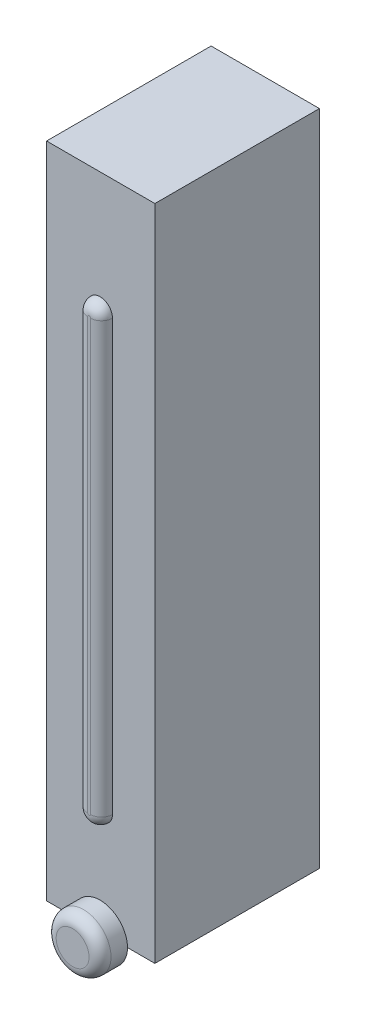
ISO-10303-21;
HEADER;
FILE_DESCRIPTION(('STEP AP214'),'2;1');
FILE_NAME('part.step','',(''),(''),'','','');
FILE_SCHEMA(('AUTOMOTIVE_DESIGN { 1 0 10303 214 1 1 1 1 }'));
ENDSEC;
DATA;
#1=APPLICATION_CONTEXT('core data for automotive mechanical design processes');
#2=APPLICATION_PROTOCOL_DEFINITION('international standard','automotive_design',2000,#1);
#3=PRODUCT_CONTEXT('',#1,'mechanical');
#4=PRODUCT('Part','Part','',(#3));
#5=PRODUCT_RELATED_PRODUCT_CATEGORY('part','',(#4));
#6=PRODUCT_DEFINITION_FORMATION('','',#4);
#7=PRODUCT_DEFINITION_CONTEXT('part definition',#1,'design');
#8=PRODUCT_DEFINITION('design','',#6,#7);
#9=PRODUCT_DEFINITION_SHAPE('','',#8);
#10=(LENGTH_UNIT() NAMED_UNIT(*) SI_UNIT(.MILLI.,.METRE.));
#11=(NAMED_UNIT(*) PLANE_ANGLE_UNIT() SI_UNIT($,.RADIAN.));
#12=(NAMED_UNIT(*) SI_UNIT($,.STERADIAN.) SOLID_ANGLE_UNIT());
#13=UNCERTAINTY_MEASURE_WITH_UNIT(LENGTH_MEASURE(1.E-05),#10,'distance_accuracy_value','');
#14=(GEOMETRIC_REPRESENTATION_CONTEXT(3) GLOBAL_UNCERTAINTY_ASSIGNED_CONTEXT((#13)) GLOBAL_UNIT_ASSIGNED_CONTEXT((#10,
#11,#12)) REPRESENTATION_CONTEXT('',''));
#15=CARTESIAN_POINT('',(0.,0.,0.));
#16=DIRECTION('',(0.,0.,1.));
#17=DIRECTION('',(1.,0.,0.));
#18=AXIS2_PLACEMENT_3D('',#15,#16,#17);
#19=CARTESIAN_POINT('',(0.,304.8,76.2));
#20=DIRECTION('',(0.,0.,-1.));
#21=DIRECTION('',(-1.,0.,0.));
#22=AXIS2_PLACEMENT_3D('',#19,#20,#21);
#23=PLANE('',#22);
#24=DIRECTION('',(0.,1.,0.));
#25=VECTOR('',#24,1.);
#26=CARTESIAN_POINT('',(51.435,304.8,76.2));
#27=LINE('',#26,#25);
#28=CARTESIAN_POINT('',(51.4350000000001,0.,76.2));
#29=VERTEX_POINT('',#28);
#30=CARTESIAN_POINT('',(51.435,304.8,76.2));
#31=VERTEX_POINT('',#30);
#32=EDGE_CURVE('E160',#29,#31,#27,.T.);
#33=ORIENTED_EDGE('',*,*,#32,.F.);
#34=DIRECTION('',(1.,0.,0.));
#35=VECTOR('',#34,1.);
#36=CARTESIAN_POINT('',(0.,0.,76.2));
#37=LINE('',#36,#35);
#38=CARTESIAN_POINT('',(63.5,0.,76.2));
#39=VERTEX_POINT('',#38);
#40=EDGE_CURVE('E128',#29,#39,#37,.T.);
#41=ORIENTED_EDGE('',*,*,#40,.T.);
#42=CARTESIAN_POINT('',(76.2,0.,76.2));
#43=DIRECTION('',(0.,0.,1.));
#44=DIRECTION('',(1.,0.,0.));
#45=AXIS2_PLACEMENT_3D('',#42,#43,#44);
#46=CIRCLE('',#45,12.7);
#47=CARTESIAN_POINT('',(88.9,0.,76.2));
#48=VERTEX_POINT('',#47);
#49=EDGE_CURVE('E156',#48,#39,#46,.T.);
#50=ORIENTED_EDGE('',*,*,#49,.F.);
#51=CARTESIAN_POINT('',(101.6,0.,76.2));
#52=VERTEX_POINT('',#51);
#53=EDGE_CURVE('E131',#48,#52,#37,.T.);
#54=ORIENTED_EDGE('',*,*,#53,.T.);
#55=DIRECTION('',(0.,-1.,0.));
#56=VECTOR('',#55,1.);
#57=CARTESIAN_POINT('',(101.6,304.8,76.2));
#58=LINE('',#57,#56);
#59=CARTESIAN_POINT('',(101.6,304.8,76.2));
#60=VERTEX_POINT('',#59);
#61=EDGE_CURVE('E137',#60,#52,#58,.T.);
#62=ORIENTED_EDGE('',*,*,#61,.F.);
#63=DIRECTION('',(1.,0.,0.));
#64=VECTOR('',#63,1.);
#65=CARTESIAN_POINT('',(0.,304.8,76.2));
#66=LINE('',#65,#64);
#67=EDGE_CURVE('E152',#31,#60,#66,.T.);
#68=ORIENTED_EDGE('',*,*,#67,.F.);
#69=EDGE_LOOP('',(#33,#41,#50,#54,#62,#68));
#70=FACE_BOUND('',#69,.T.);
#71=CARTESIAN_POINT('',(76.2,248.986126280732,76.2));
#72=DIRECTION('',(0.,0.,1.));
#73=DIRECTION('',(-1.,0.,0.));
#74=AXIS2_PLACEMENT_3D('',#71,#72,#73);
#75=CIRCLE('',#74,5.75969716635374);
#76=CARTESIAN_POINT('',(81.9596971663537,248.986126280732,76.2));
#77=VERTEX_POINT('',#76);
#78=CARTESIAN_POINT('',(70.4403028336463,248.986126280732,76.2));
#79=VERTEX_POINT('',#78);
#80=EDGE_CURVE('E107',#77,#79,#75,.T.);
#81=ORIENTED_EDGE('',*,*,#80,.F.);
#82=DIRECTION('',(0.,1.,0.));
#83=VECTOR('',#82,1.);
#84=CARTESIAN_POINT('',(81.9596971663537,248.986126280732,76.2));
#85=LINE('',#84,#83);
#86=CARTESIAN_POINT('',(81.9596971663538,49.9073626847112,76.2));
#87=VERTEX_POINT('',#86);
#88=EDGE_CURVE('E111',#87,#77,#85,.T.);
#89=ORIENTED_EDGE('',*,*,#88,.F.);
#90=CARTESIAN_POINT('',(76.2,49.9073626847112,76.2));
#91=DIRECTION('',(0.,0.,1.));
#92=DIRECTION('',(1.,0.,0.));
#93=AXIS2_PLACEMENT_3D('',#90,#91,#92);
#94=CIRCLE('',#93,5.75969716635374);
#95=CARTESIAN_POINT('',(70.4403028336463,49.9073626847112,76.2));
#96=VERTEX_POINT('',#95);
#97=EDGE_CURVE('E129',#96,#87,#94,.T.);
#98=ORIENTED_EDGE('',*,*,#97,.F.);
#99=DIRECTION('',(0.,-1.,0.));
#100=VECTOR('',#99,1.);
#101=CARTESIAN_POINT('',(70.4403028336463,248.986126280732,76.2));
#102=LINE('',#101,#100);
#103=EDGE_CURVE('E114',#79,#96,#102,.T.);
#104=ORIENTED_EDGE('',*,*,#103,.F.);
#105=EDGE_LOOP('',(#81,#89,#98,#104));
#106=FACE_BOUND('',#105,.T.);
#107=ADVANCED_FACE('F37',(#70,#106),#23,.F.);
#108=CARTESIAN_POINT('',(0.,304.8,0.));
#109=DIRECTION('',(0.,0.,1.));
#110=DIRECTION('',(1.,0.,0.));
#111=AXIS2_PLACEMENT_3D('',#108,#109,#110);
#112=PLANE('',#111);
#113=DIRECTION('',(0.,-1.,0.));
#114=VECTOR('',#113,1.);
#115=CARTESIAN_POINT('',(51.435,304.8,0.));
#116=LINE('',#115,#114);
#117=CARTESIAN_POINT('',(51.435,304.8,0.));
#118=VERTEX_POINT('',#117);
#119=CARTESIAN_POINT('',(51.4350000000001,0.,0.));
#120=VERTEX_POINT('',#119);
#121=EDGE_CURVE('E163',#118,#120,#116,.T.);
#122=ORIENTED_EDGE('',*,*,#121,.F.);
#123=DIRECTION('',(-1.,0.,0.));
#124=VECTOR('',#123,1.);
#125=CARTESIAN_POINT('',(0.,304.8,0.));
#126=LINE('',#125,#124);
#127=CARTESIAN_POINT('',(101.6,304.8,0.));
#128=VERTEX_POINT('',#127);
#129=EDGE_CURVE('E147',#128,#118,#126,.T.);
#130=ORIENTED_EDGE('',*,*,#129,.F.);
#131=DIRECTION('',(0.,-1.,0.));
#132=VECTOR('',#131,1.);
#133=CARTESIAN_POINT('',(101.6,304.8,0.));
#134=LINE('',#133,#132);
#135=CARTESIAN_POINT('',(101.6,0.,0.));
#136=VERTEX_POINT('',#135);
#137=EDGE_CURVE('E141',#128,#136,#134,.T.);
#138=ORIENTED_EDGE('',*,*,#137,.T.);
#139=DIRECTION('',(-1.,0.,0.));
#140=VECTOR('',#139,1.);
#141=CARTESIAN_POINT('',(0.,0.,0.));
#142=LINE('',#141,#140);
#143=EDGE_CURVE('E144',#136,#120,#142,.T.);
#144=ORIENTED_EDGE('',*,*,#143,.T.);
#145=EDGE_LOOP('',(#122,#130,#138,#144));
#146=FACE_BOUND('',#145,.T.);
#147=ADVANCED_FACE('F201',(#146),#112,.F.);
#148=CARTESIAN_POINT('',(0.,304.8,0.));
#149=DIRECTION('',(0.,1.,0.));
#150=DIRECTION('',(0.,0.,1.));
#151=AXIS2_PLACEMENT_3D('',#148,#149,#150);
#152=PLANE('',#151);
#153=ORIENTED_EDGE('',*,*,#129,.T.);
#154=DIRECTION('',(0.,0.,-1.));
#155=VECTOR('',#154,1.);
#156=CARTESIAN_POINT('',(51.435,304.8,195.072));
#157=LINE('',#156,#155);
#158=EDGE_CURVE('E162',#31,#118,#157,.T.);
#159=ORIENTED_EDGE('',*,*,#158,.F.);
#160=ORIENTED_EDGE('',*,*,#67,.T.);
#161=DIRECTION('',(0.,0.,-1.));
#162=VECTOR('',#161,1.);
#163=CARTESIAN_POINT('',(101.6,304.8,0.));
#164=LINE('',#163,#162);
#165=EDGE_CURVE('E153',#60,#128,#164,.T.);
#166=ORIENTED_EDGE('',*,*,#165,.T.);
#167=EDGE_LOOP('',(#153,#159,#160,#166));
#168=FACE_BOUND('',#167,.T.);
#169=ADVANCED_FACE('F208',(#168),#152,.T.);
#170=CARTESIAN_POINT('',(0.,0.,0.));
#171=DIRECTION('',(0.,1.,0.));
#172=DIRECTION('',(0.,0.,1.));
#173=AXIS2_PLACEMENT_3D('',#170,#171,#172);
#174=PLANE('',#173);
#175=CARTESIAN_POINT('',(76.5175,0.,38.1));
#176=DIRECTION('',(0.,1.,0.));
#177=DIRECTION('',(0.,0.,1.));
#178=AXIS2_PLACEMENT_3D('',#175,#176,#177);
#179=CIRCLE('',#178,10.2564098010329);
#180=CARTESIAN_POINT('',(76.5175,0.,48.3564098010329));
#181=VERTEX_POINT('',#180);
#182=EDGE_CURVE('E11',#181,#181,#179,.F.);
#183=ORIENTED_EDGE('',*,*,#182,.F.);
#184=EDGE_LOOP('',(#183));
#185=FACE_BOUND('',#184,.T.);
#186=DIRECTION('',(0.,0.,-1.));
#187=VECTOR('',#186,1.);
#188=CARTESIAN_POINT('',(51.4350000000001,0.,195.072));
#189=LINE('',#188,#187);
#190=EDGE_CURVE('E149',#29,#120,#189,.T.);
#191=ORIENTED_EDGE('',*,*,#190,.T.);
#192=ORIENTED_EDGE('',*,*,#143,.F.);
#193=DIRECTION('',(0.,0.,-1.));
#194=VECTOR('',#193,1.);
#195=CARTESIAN_POINT('',(101.6,0.,0.));
#196=LINE('',#195,#194);
#197=EDGE_CURVE('E140',#52,#136,#196,.T.);
#198=ORIENTED_EDGE('',*,*,#197,.F.);
#199=ORIENTED_EDGE('',*,*,#53,.F.);
#200=EDGE_CURVE('E133',#39,#48,#37,.T.);
#201=ORIENTED_EDGE('',*,*,#200,.F.);
#202=ORIENTED_EDGE('',*,*,#40,.F.);
#203=EDGE_LOOP('',(#191,#192,#198,#199,#201,#202));
#204=FACE_BOUND('',#203,.T.);
#205=ADVANCED_FACE('F215',(#185,#204),#174,.F.);
#206=CARTESIAN_POINT('',(101.6,304.8,0.));
#207=DIRECTION('',(-1.,0.,0.));
#208=DIRECTION('',(0.,0.,1.));
#209=AXIS2_PLACEMENT_3D('',#206,#207,#208);
#210=PLANE('',#209);
#211=ORIENTED_EDGE('',*,*,#197,.T.);
#212=ORIENTED_EDGE('',*,*,#137,.F.);
#213=ORIENTED_EDGE('',*,*,#165,.F.);
#214=ORIENTED_EDGE('',*,*,#61,.T.);
#215=EDGE_LOOP('',(#211,#212,#213,#214));
#216=FACE_BOUND('',#215,.T.);
#217=ADVANCED_FACE('F213',(#216),#210,.F.);
#218=CARTESIAN_POINT('',(0.,0.,76.2));
#219=DIRECTION('',(0.,0.,1.));
#220=DIRECTION('',(1.,0.,0.));
#221=AXIS2_PLACEMENT_3D('',#218,#219,#220);
#222=PLANE('',#221);
#223=EDGE_CURVE('E159',#39,#48,#46,.T.);
#224=ORIENTED_EDGE('',*,*,#223,.F.);
#225=ORIENTED_EDGE('',*,*,#200,.T.);
#226=EDGE_LOOP('',(#224,#225));
#227=FACE_BOUND('',#226,.T.);
#228=ADVANCED_FACE('F214',(#227),#222,.F.);
#229=CARTESIAN_POINT('',(76.2,0.,88.9));
#230=DIRECTION('',(0.,0.,-1.));
#231=DIRECTION('',(-1.,0.,0.));
#232=AXIS2_PLACEMENT_3D('',#229,#230,#231);
#233=CYLINDRICAL_SURFACE('',#232,12.7);
#234=CARTESIAN_POINT('',(76.2,0.,83.82));
#235=DIRECTION('',(0.,0.,1.));
#236=DIRECTION('',(1.,0.,0.));
#237=AXIS2_PLACEMENT_3D('',#234,#235,#236);
#238=CIRCLE('',#237,12.7);
#239=CARTESIAN_POINT('',(88.9,0.,83.82));
#240=VERTEX_POINT('',#239);
#241=EDGE_CURVE('E171',#240,#240,#238,.F.);
#242=ORIENTED_EDGE('',*,*,#241,.T.);
#243=EDGE_LOOP('',(#242));
#244=FACE_BOUND('',#243,.T.);
#245=ORIENTED_EDGE('',*,*,#49,.T.);
#246=ORIENTED_EDGE('',*,*,#223,.T.);
#247=EDGE_LOOP('',(#245,#246));
#248=FACE_BOUND('',#247,.T.);
#249=ADVANCED_FACE('F225',(#244,#248),#233,.T.);
#250=CARTESIAN_POINT('',(0.,0.,88.9));
#251=DIRECTION('',(0.,0.,1.));
#252=DIRECTION('',(1.,0.,0.));
#253=AXIS2_PLACEMENT_3D('',#250,#251,#252);
#254=PLANE('',#253);
#255=CARTESIAN_POINT('',(76.2,0.,88.9));
#256=DIRECTION('',(0.,0.,1.));
#257=DIRECTION('',(1.,0.,0.));
#258=AXIS2_PLACEMENT_3D('',#255,#256,#257);
#259=CIRCLE('',#258,7.62000000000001);
#260=CARTESIAN_POINT('',(83.82,0.,88.9));
#261=VERTEX_POINT('',#260);
#262=EDGE_CURVE('E165',#261,#261,#259,.T.);
#263=ORIENTED_EDGE('',*,*,#262,.T.);
#264=EDGE_LOOP('',(#263));
#265=FACE_BOUND('',#264,.T.);
#266=ADVANCED_FACE('F228',(#265),#254,.T.);
#267=CARTESIAN_POINT('',(51.435,304.8,195.072));
#268=DIRECTION('',(-1.,0.,0.));
#269=DIRECTION('',(0.,-1.,0.));
#270=AXIS2_PLACEMENT_3D('',#267,#268,#269);
#271=PLANE('',#270);
#272=ORIENTED_EDGE('',*,*,#32,.T.);
#273=ORIENTED_EDGE('',*,*,#158,.T.);
#274=ORIENTED_EDGE('',*,*,#121,.T.);
#275=ORIENTED_EDGE('',*,*,#190,.F.);
#276=EDGE_LOOP('',(#272,#273,#274,#275));
#277=FACE_BOUND('',#276,.T.);
#278=ADVANCED_FACE('F195',(#277),#271,.T.);
#279=CARTESIAN_POINT('',(76.2,0.,83.82));
#280=DIRECTION('',(0.,0.,1.));
#281=DIRECTION('',(1.,0.,0.));
#282=AXIS2_PLACEMENT_3D('',#279,#280,#281);
#283=TOROIDAL_SURFACE('',#282,7.62000000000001,5.08);
#284=ORIENTED_EDGE('',*,*,#241,.F.);
#285=EDGE_LOOP('',(#284));
#286=FACE_BOUND('',#285,.T.);
#287=ORIENTED_EDGE('',*,*,#262,.F.);
#288=EDGE_LOOP('',(#287));
#289=FACE_BOUND('',#288,.T.);
#290=ADVANCED_FACE('F188',(#286,#289),#283,.T.);
#291=CARTESIAN_POINT('',(76.2,248.986126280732,81.28));
#292=DIRECTION('',(0.,0.,-1.));
#293=DIRECTION('',(-1.,0.,0.));
#294=AXIS2_PLACEMENT_3D('',#291,#292,#293);
#295=PLANE('',#294);
#296=DIRECTION('',(0.,-1.,0.));
#297=VECTOR('',#296,1.);
#298=CARTESIAN_POINT('',(75.5203028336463,248.986126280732,81.28));
#299=LINE('',#298,#297);
#300=CARTESIAN_POINT('',(75.5203028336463,248.986126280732,81.28));
#301=VERTEX_POINT('',#300);
#302=CARTESIAN_POINT('',(75.5203028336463,49.9073626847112,81.28));
#303=VERTEX_POINT('',#302);
#304=EDGE_CURVE('E52',#301,#303,#299,.T.);
#305=ORIENTED_EDGE('',*,*,#304,.T.);
#306=CARTESIAN_POINT('',(76.2,49.9073626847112,81.28));
#307=DIRECTION('',(0.,0.,-1.));
#308=DIRECTION('',(-1.,0.,0.));
#309=AXIS2_PLACEMENT_3D('',#306,#307,#308);
#310=CIRCLE('',#309,0.679697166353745);
#311=CARTESIAN_POINT('',(76.8796971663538,49.9073626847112,81.28));
#312=VERTEX_POINT('',#311);
#313=EDGE_CURVE('E45',#303,#312,#310,.F.);
#314=ORIENTED_EDGE('',*,*,#313,.T.);
#315=DIRECTION('',(0.,1.,0.));
#316=VECTOR('',#315,1.);
#317=CARTESIAN_POINT('',(76.8796971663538,248.986126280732,81.28));
#318=LINE('',#317,#316);
#319=CARTESIAN_POINT('',(76.8796971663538,248.986126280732,81.28));
#320=VERTEX_POINT('',#319);
#321=EDGE_CURVE('E174',#312,#320,#318,.T.);
#322=ORIENTED_EDGE('',*,*,#321,.T.);
#323=CARTESIAN_POINT('',(76.2,248.986126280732,81.28));
#324=DIRECTION('',(0.,0.,-1.));
#325=DIRECTION('',(-1.,0.,0.));
#326=AXIS2_PLACEMENT_3D('',#323,#324,#325);
#327=CIRCLE('',#326,0.679697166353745);
#328=EDGE_CURVE('E57',#320,#301,#327,.F.);
#329=ORIENTED_EDGE('',*,*,#328,.T.);
#330=EDGE_LOOP('',(#305,#314,#322,#329));
#331=FACE_BOUND('',#330,.T.);
#332=ADVANCED_FACE('F186',(#331),#295,.F.);
#333=CARTESIAN_POINT('',(76.2,248.986126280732,76.2));
#334=DIRECTION('',(0.,0.,-1.));
#335=DIRECTION('',(-1.,0.,0.));
#336=AXIS2_PLACEMENT_3D('',#333,#334,#335);
#337=DEGENERATE_TOROIDAL_SURFACE('',#336,0.679697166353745,5.08,.T.);
#338=CARTESIAN_POINT('',(76.8796971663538,248.986126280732,76.2));
#339=DIRECTION('',(0.,-1.,0.));
#340=DIRECTION('',(0.,0.,-1.));
#341=AXIS2_PLACEMENT_3D('',#338,#339,#340);
#342=CIRCLE('',#341,5.08);
#343=EDGE_CURVE('E120',#77,#320,#342,.T.);
#344=ORIENTED_EDGE('',*,*,#343,.F.);
#345=ORIENTED_EDGE('',*,*,#80,.T.);
#346=CARTESIAN_POINT('',(75.5203028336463,248.986126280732,76.2));
#347=DIRECTION('',(0.,-1.,0.));
#348=DIRECTION('',(0.,0.,-1.));
#349=AXIS2_PLACEMENT_3D('',#346,#347,#348);
#350=CIRCLE('',#349,5.08);
#351=EDGE_CURVE('E117',#301,#79,#350,.T.);
#352=ORIENTED_EDGE('',*,*,#351,.F.);
#353=ORIENTED_EDGE('',*,*,#328,.F.);
#354=EDGE_LOOP('',(#344,#345,#352,#353));
#355=FACE_BOUND('',#354,.T.);
#356=ADVANCED_FACE('F39',(#355),#337,.T.);
#357=CARTESIAN_POINT('',(75.5203028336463,248.986126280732,76.2));
#358=DIRECTION('',(0.,-1.,0.));
#359=DIRECTION('',(1.,0.,0.));
#360=AXIS2_PLACEMENT_3D('',#357,#358,#359);
#361=CYLINDRICAL_SURFACE('',#360,5.08);
#362=ORIENTED_EDGE('',*,*,#351,.T.);
#363=ORIENTED_EDGE('',*,*,#103,.T.);
#364=CARTESIAN_POINT('',(75.5203028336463,49.9073626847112,76.2));
#365=DIRECTION('',(0.,-1.,0.));
#366=DIRECTION('',(0.,0.,-1.));
#367=AXIS2_PLACEMENT_3D('',#364,#365,#366);
#368=CIRCLE('',#367,5.08);
#369=EDGE_CURVE('E123',#303,#96,#368,.T.);
#370=ORIENTED_EDGE('',*,*,#369,.F.);
#371=ORIENTED_EDGE('',*,*,#304,.F.);
#372=EDGE_LOOP('',(#362,#363,#370,#371));
#373=FACE_BOUND('',#372,.T.);
#374=ADVANCED_FACE('F182',(#373),#361,.T.);
#375=CARTESIAN_POINT('',(76.8796971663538,248.986126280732,76.2));
#376=DIRECTION('',(0.,1.,0.));
#377=DIRECTION('',(-1.,0.,0.));
#378=AXIS2_PLACEMENT_3D('',#375,#376,#377);
#379=CYLINDRICAL_SURFACE('',#378,5.08);
#380=ORIENTED_EDGE('',*,*,#343,.T.);
#381=ORIENTED_EDGE('',*,*,#321,.F.);
#382=CARTESIAN_POINT('',(76.8796971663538,49.9073626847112,76.2));
#383=DIRECTION('',(0.,-1.,0.));
#384=DIRECTION('',(0.,0.,-1.));
#385=AXIS2_PLACEMENT_3D('',#382,#383,#384);
#386=CIRCLE('',#385,5.08);
#387=EDGE_CURVE('E127',#87,#312,#386,.T.);
#388=ORIENTED_EDGE('',*,*,#387,.F.);
#389=ORIENTED_EDGE('',*,*,#88,.T.);
#390=EDGE_LOOP('',(#380,#381,#388,#389));
#391=FACE_BOUND('',#390,.T.);
#392=ADVANCED_FACE('F126',(#391),#379,.T.);
#393=CARTESIAN_POINT('',(76.2,49.9073626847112,76.2));
#394=DIRECTION('',(0.,0.,-1.));
#395=DIRECTION('',(-1.,0.,0.));
#396=AXIS2_PLACEMENT_3D('',#393,#394,#395);
#397=DEGENERATE_TOROIDAL_SURFACE('',#396,0.679697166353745,5.08,.T.);
#398=ORIENTED_EDGE('',*,*,#369,.T.);
#399=ORIENTED_EDGE('',*,*,#97,.T.);
#400=ORIENTED_EDGE('',*,*,#387,.T.);
#401=ORIENTED_EDGE('',*,*,#313,.F.);
#402=EDGE_LOOP('',(#398,#399,#400,#401));
#403=FACE_BOUND('',#402,.T.);
#404=ADVANCED_FACE('F185',(#403),#397,.T.);
#405=CARTESIAN_POINT('',(76.5175,-9.652,38.1));
#406=DIRECTION('',(0.,-1.,0.));
#407=DIRECTION('',(0.,0.,-1.));
#408=AXIS2_PLACEMENT_3D('',#405,#406,#407);
#409=PLANE('',#408);
#410=CARTESIAN_POINT('',(76.5175,-9.652,38.1));
#411=DIRECTION('',(0.,-1.,0.));
#412=DIRECTION('',(0.,0.,-1.));
#413=AXIS2_PLACEMENT_3D('',#410,#411,#412);
#414=CIRCLE('',#413,10.2564098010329);
#415=CARTESIAN_POINT('',(76.5175,-9.652,48.3564098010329));
#416=VERTEX_POINT('',#415);
#417=EDGE_CURVE('E180',#416,#416,#414,.T.);
#418=ORIENTED_EDGE('',*,*,#417,.T.);
#419=EDGE_LOOP('',(#418));
#420=FACE_BOUND('',#419,.T.);
#421=CARTESIAN_POINT('',(76.5175,-9.652,38.1));
#422=DIRECTION('',(0.,-1.,0.));
#423=DIRECTION('',(0.,0.,-1.));
#424=AXIS2_PLACEMENT_3D('',#421,#422,#423);
#425=CIRCLE('',#424,7.7164098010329);
#426=CARTESIAN_POINT('',(76.5175,-9.652,45.8164098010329));
#427=VERTEX_POINT('',#426);
#428=EDGE_CURVE('E402',#427,#427,#425,.T.);
#429=ORIENTED_EDGE('',*,*,#428,.F.);
#430=EDGE_LOOP('',(#429));
#431=FACE_BOUND('',#430,.T.);
#432=ADVANCED_FACE('F240',(#420,#431),#409,.T.);
#433=CARTESIAN_POINT('',(76.5175,-9.652,38.1));
#434=DIRECTION('',(0.,1.,0.));
#435=DIRECTION('',(0.,0.,1.));
#436=AXIS2_PLACEMENT_3D('',#433,#434,#435);
#437=CYLINDRICAL_SURFACE('',#436,10.2564098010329);
#438=CARTESIAN_POINT('',(76.5175,-9.652,48.3564098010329));
#439=CARTESIAN_POINT('',(76.5175,-9.55145833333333,48.3564098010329));
#440=CARTESIAN_POINT('',(76.5175,-9.45091666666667,48.3564098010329));
#441=CARTESIAN_POINT('',(76.5175,-9.24983333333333,48.3564098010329));
#442=CARTESIAN_POINT('',(76.5175,-9.14929166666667,48.3564098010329));
#443=CARTESIAN_POINT('',(76.5175,-8.94820833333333,48.3564098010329));
#444=CARTESIAN_POINT('',(76.5175,-8.84766666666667,48.3564098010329));
#445=CARTESIAN_POINT('',(76.5175,-8.64658333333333,48.3564098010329));
#446=CARTESIAN_POINT('',(76.5175,-8.54604166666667,48.3564098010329));
#447=CARTESIAN_POINT('',(76.5175,-8.34495833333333,48.3564098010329));
#448=CARTESIAN_POINT('',(76.5175,-8.24441666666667,48.3564098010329));
#449=CARTESIAN_POINT('',(76.5175,-8.04333333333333,48.3564098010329));
#450=CARTESIAN_POINT('',(76.5175,-7.94279166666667,48.3564098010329));
#451=CARTESIAN_POINT('',(76.5175,-7.74170833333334,48.3564098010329));
#452=CARTESIAN_POINT('',(76.5175,-7.64116666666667,48.3564098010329));
#453=CARTESIAN_POINT('',(76.5175,-7.44008333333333,48.3564098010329));
#454=CARTESIAN_POINT('',(76.5175,-7.33954166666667,48.3564098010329));
#455=CARTESIAN_POINT('',(76.5175,-7.13845833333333,48.3564098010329));
#456=CARTESIAN_POINT('',(76.5175,-7.03791666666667,48.3564098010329));
#457=CARTESIAN_POINT('',(76.5175,-6.83683333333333,48.3564098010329));
#458=CARTESIAN_POINT('',(76.5175,-6.73629166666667,48.3564098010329));
#459=CARTESIAN_POINT('',(76.5175,-6.53520833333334,48.3564098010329));
#460=CARTESIAN_POINT('',(76.5175,-6.43466666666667,48.3564098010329));
#461=CARTESIAN_POINT('',(76.5175,-6.23358333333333,48.3564098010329));
#462=CARTESIAN_POINT('',(76.5175,-6.13304166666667,48.3564098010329));
#463=CARTESIAN_POINT('',(76.5175,-5.93195833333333,48.3564098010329));
#464=CARTESIAN_POINT('',(76.5175,-5.83141666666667,48.3564098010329));
#465=CARTESIAN_POINT('',(76.5175,-5.63033333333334,48.3564098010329));
#466=CARTESIAN_POINT('',(76.5175,-5.52979166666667,48.3564098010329));
#467=CARTESIAN_POINT('',(76.5175,-5.32870833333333,48.3564098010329));
#468=CARTESIAN_POINT('',(76.5175,-5.22816666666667,48.3564098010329));
#469=CARTESIAN_POINT('',(76.5175,-5.02708333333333,48.3564098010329));
#470=CARTESIAN_POINT('',(76.5175,-4.92654166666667,48.3564098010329));
#471=CARTESIAN_POINT('',(76.5175,-4.72545833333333,48.3564098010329));
#472=CARTESIAN_POINT('',(76.5175,-4.62491666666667,48.3564098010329));
#473=CARTESIAN_POINT('',(76.5175,-4.42383333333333,48.3564098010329));
#474=CARTESIAN_POINT('',(76.5175,-4.32329166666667,48.3564098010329));
#475=CARTESIAN_POINT('',(76.5175,-4.12220833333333,48.3564098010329));
#476=CARTESIAN_POINT('',(76.5175,-4.02166666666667,48.3564098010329));
#477=CARTESIAN_POINT('',(76.5175,-3.82058333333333,48.3564098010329));
#478=CARTESIAN_POINT('',(76.5175,-3.72004166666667,48.3564098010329));
#479=CARTESIAN_POINT('',(76.5175,-3.51895833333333,48.3564098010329));
#480=CARTESIAN_POINT('',(76.5175,-3.41841666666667,48.3564098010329));
#481=CARTESIAN_POINT('',(76.5175,-3.21733333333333,48.3564098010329));
#482=CARTESIAN_POINT('',(76.5175,-3.11679166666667,48.3564098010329));
#483=CARTESIAN_POINT('',(76.5175,-2.91570833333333,48.3564098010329));
#484=CARTESIAN_POINT('',(76.5175,-2.81516666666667,48.3564098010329));
#485=CARTESIAN_POINT('',(76.5175,-2.61408333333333,48.3564098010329));
#486=CARTESIAN_POINT('',(76.5175,-2.51354166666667,48.3564098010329));
#487=CARTESIAN_POINT('',(76.5175,-2.31245833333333,48.3564098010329));
#488=CARTESIAN_POINT('',(76.5175,-2.21191666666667,48.3564098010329));
#489=CARTESIAN_POINT('',(76.5175,-2.01083333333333,48.3564098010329));
#490=CARTESIAN_POINT('',(76.5175,-1.91029166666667,48.3564098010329));
#491=CARTESIAN_POINT('',(76.5175,-1.70920833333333,48.3564098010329));
#492=CARTESIAN_POINT('',(76.5175,-1.60866666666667,48.3564098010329));
#493=CARTESIAN_POINT('',(76.5175,-1.40758333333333,48.3564098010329));
#494=CARTESIAN_POINT('',(76.5175,-1.30704166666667,48.3564098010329));
#495=CARTESIAN_POINT('',(76.5175,-1.10595833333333,48.3564098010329));
#496=CARTESIAN_POINT('',(76.5175,-1.00541666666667,48.3564098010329));
#497=CARTESIAN_POINT('',(76.5175,-0.804333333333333,48.3564098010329));
#498=CARTESIAN_POINT('',(76.5175,-0.703791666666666,48.3564098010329));
#499=CARTESIAN_POINT('',(76.5175,-0.502708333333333,48.3564098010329));
#500=CARTESIAN_POINT('',(76.5175,-0.402166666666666,48.3564098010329));
#501=CARTESIAN_POINT('',(76.5175,-0.201083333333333,48.3564098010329));
#502=CARTESIAN_POINT('',(76.5175,-0.100541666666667,48.3564098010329));
#503=CARTESIAN_POINT('',(76.5175,0.,48.3564098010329));
#504=B_SPLINE_CURVE_WITH_KNOTS('',3,(#438,#439,#440,#441,#442,#443,#444,#445,#446,#447,#448,
#449,#450,#451,#452,#453,#454,#455,#456,#457,#458,#459,#460,#461,#462,#463,#464,#465,#466,#467,
#468,#469,#470,#471,#472,#473,#474,#475,#476,#477,#478,#479,#480,#481,#482,#483,#484,#485,#486,
#487,#488,#489,#490,#491,#492,#493,#494,#495,#496,#497,#498,#499,#500,#501,#502,#503),
.UNSPECIFIED.,.F.,.F.,(4,2,2,2,2,2,2,2,2,2,2,2,2,2,2,2,2,2,2,2,2,2,2,2,2,2,2,2,2,2,2,2,4),(0.,
0.301625,0.60325,0.904874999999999,1.2065,1.508125,1.80975,2.111375,2.413,2.714625,3.01625,
3.317875,3.6195,3.921125,4.22275,4.524375,4.826,5.127625,5.42925,5.730875,6.0325,6.334125,
6.63575,6.937375,7.239,7.540625,7.84225,8.143875,8.4455,8.747125,9.04875,9.350375,9.652),.UNSPECIFIED.);
#505=EDGE_CURVE('BSEAM255',#416,#181,#504,.T.);
#506=ORIENTED_EDGE('',*,*,#417,.F.);
#507=ORIENTED_EDGE('',*,*,#182,.T.);
#508=ORIENTED_EDGE('',*,*,#505,.T.);
#509=ORIENTED_EDGE('',*,*,#505,.F.);
#510=EDGE_LOOP('',(#506,#508,#507,#509));
#511=FACE_BOUND('',#510,.T.);
#512=ADVANCED_FACE('F255',(#511),#437,.T.);
#513=CARTESIAN_POINT('',(76.5175,-9.652,38.1));
#514=DIRECTION('',(0.,1.,0.));
#515=DIRECTION('',(0.,0.,1.));
#516=AXIS2_PLACEMENT_3D('',#513,#514,#515);
#517=CYLINDRICAL_SURFACE('',#516,7.7164098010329);
#518=CARTESIAN_POINT('',(76.5175,0.,38.1));
#519=DIRECTION('',(0.,-1.,0.));
#520=DIRECTION('',(0.,0.,-1.));
#521=AXIS2_PLACEMENT_3D('',#518,#519,#520);
#522=CIRCLE('',#521,7.7164098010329);
#523=CARTESIAN_POINT('',(76.5175,0.,45.8164098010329));
#524=VERTEX_POINT('',#523);
#525=EDGE_CURVE('E400',#524,#524,#522,.T.);
#526=CARTESIAN_POINT('',(76.5175,-9.652,45.8164098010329));
#527=CARTESIAN_POINT('',(76.5175,-9.55145833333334,45.8164098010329));
#528=CARTESIAN_POINT('',(76.5175,-9.45091666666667,45.8164098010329));
#529=CARTESIAN_POINT('',(76.5175,-9.24983333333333,45.8164098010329));
#530=CARTESIAN_POINT('',(76.5175,-9.14929166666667,45.8164098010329));
#531=CARTESIAN_POINT('',(76.5175,-8.94820833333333,45.8164098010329));
#532=CARTESIAN_POINT('',(76.5175,-8.84766666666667,45.8164098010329));
#533=CARTESIAN_POINT('',(76.5175,-8.64658333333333,45.8164098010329));
#534=CARTESIAN_POINT('',(76.5175,-8.54604166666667,45.8164098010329));
#535=CARTESIAN_POINT('',(76.5175,-8.34495833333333,45.8164098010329));
#536=CARTESIAN_POINT('',(76.5175,-8.24441666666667,45.8164098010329));
#537=CARTESIAN_POINT('',(76.5175,-8.04333333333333,45.8164098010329));
#538=CARTESIAN_POINT('',(76.5175,-7.94279166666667,45.8164098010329));
#539=CARTESIAN_POINT('',(76.5175,-7.74170833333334,45.8164098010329));
#540=CARTESIAN_POINT('',(76.5175,-7.64116666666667,45.8164098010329));
#541=CARTESIAN_POINT('',(76.5175,-7.44008333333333,45.8164098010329));
#542=CARTESIAN_POINT('',(76.5175,-7.33954166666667,45.8164098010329));
#543=CARTESIAN_POINT('',(76.5175,-7.13845833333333,45.8164098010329));
#544=CARTESIAN_POINT('',(76.5175,-7.03791666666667,45.8164098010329));
#545=CARTESIAN_POINT('',(76.5175,-6.83683333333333,45.8164098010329));
#546=CARTESIAN_POINT('',(76.5175,-6.73629166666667,45.8164098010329));
#547=CARTESIAN_POINT('',(76.5175,-6.53520833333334,45.8164098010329));
#548=CARTESIAN_POINT('',(76.5175,-6.43466666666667,45.8164098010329));
#549=CARTESIAN_POINT('',(76.5175,-6.23358333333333,45.8164098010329));
#550=CARTESIAN_POINT('',(76.5175,-6.13304166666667,45.8164098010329));
#551=CARTESIAN_POINT('',(76.5175,-5.93195833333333,45.8164098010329));
#552=CARTESIAN_POINT('',(76.5175,-5.83141666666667,45.8164098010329));
#553=CARTESIAN_POINT('',(76.5175,-5.63033333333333,45.8164098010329));
#554=CARTESIAN_POINT('',(76.5175,-5.52979166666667,45.8164098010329));
#555=CARTESIAN_POINT('',(76.5175,-5.32870833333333,45.8164098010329));
#556=CARTESIAN_POINT('',(76.5175,-5.22816666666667,45.8164098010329));
#557=CARTESIAN_POINT('',(76.5175,-5.02708333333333,45.8164098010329));
#558=CARTESIAN_POINT('',(76.5175,-4.92654166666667,45.8164098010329));
#559=CARTESIAN_POINT('',(76.5175,-4.72545833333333,45.8164098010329));
#560=CARTESIAN_POINT('',(76.5175,-4.62491666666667,45.8164098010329));
#561=CARTESIAN_POINT('',(76.5175,-4.42383333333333,45.8164098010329));
#562=CARTESIAN_POINT('',(76.5175,-4.32329166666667,45.8164098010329));
#563=CARTESIAN_POINT('',(76.5175,-4.12220833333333,45.8164098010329));
#564=CARTESIAN_POINT('',(76.5175,-4.02166666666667,45.8164098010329));
#565=CARTESIAN_POINT('',(76.5175,-3.82058333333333,45.8164098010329));
#566=CARTESIAN_POINT('',(76.5175,-3.72004166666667,45.8164098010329));
#567=CARTESIAN_POINT('',(76.5175,-3.51895833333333,45.8164098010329));
#568=CARTESIAN_POINT('',(76.5175,-3.41841666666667,45.8164098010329));
#569=CARTESIAN_POINT('',(76.5175,-3.21733333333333,45.8164098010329));
#570=CARTESIAN_POINT('',(76.5175,-3.11679166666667,45.8164098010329));
#571=CARTESIAN_POINT('',(76.5175,-2.91570833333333,45.8164098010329));
#572=CARTESIAN_POINT('',(76.5175,-2.81516666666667,45.8164098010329));
#573=CARTESIAN_POINT('',(76.5175,-2.61408333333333,45.8164098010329));
#574=CARTESIAN_POINT('',(76.5175,-2.51354166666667,45.8164098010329));
#575=CARTESIAN_POINT('',(76.5175,-2.31245833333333,45.8164098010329));
#576=CARTESIAN_POINT('',(76.5175,-2.21191666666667,45.8164098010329));
#577=CARTESIAN_POINT('',(76.5175,-2.01083333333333,45.8164098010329));
#578=CARTESIAN_POINT('',(76.5175,-1.91029166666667,45.8164098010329));
#579=CARTESIAN_POINT('',(76.5175,-1.70920833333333,45.8164098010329));
#580=CARTESIAN_POINT('',(76.5175,-1.60866666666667,45.8164098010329));
#581=CARTESIAN_POINT('',(76.5175,-1.40758333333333,45.8164098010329));
#582=CARTESIAN_POINT('',(76.5175,-1.30704166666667,45.8164098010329));
#583=CARTESIAN_POINT('',(76.5175,-1.10595833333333,45.8164098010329));
#584=CARTESIAN_POINT('',(76.5175,-1.00541666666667,45.8164098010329));
#585=CARTESIAN_POINT('',(76.5175,-0.804333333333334,45.8164098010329));
#586=CARTESIAN_POINT('',(76.5175,-0.703791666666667,45.8164098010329));
#587=CARTESIAN_POINT('',(76.5175,-0.502708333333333,45.8164098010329));
#588=CARTESIAN_POINT('',(76.5175,-0.402166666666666,45.8164098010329));
#589=CARTESIAN_POINT('',(76.5175,-0.201083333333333,45.8164098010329));
#590=CARTESIAN_POINT('',(76.5175,-0.100541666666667,45.8164098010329));
#591=CARTESIAN_POINT('',(76.5175,0.,45.8164098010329));
#592=B_SPLINE_CURVE_WITH_KNOTS('',3,(#526,#527,#528,#529,#530,#531,#532,#533,#534,#535,#536,
#537,#538,#539,#540,#541,#542,#543,#544,#545,#546,#547,#548,#549,#550,#551,#552,#553,#554,#555,
#556,#557,#558,#559,#560,#561,#562,#563,#564,#565,#566,#567,#568,#569,#570,#571,#572,#573,#574,
#575,#576,#577,#578,#579,#580,#581,#582,#583,#584,#585,#586,#587,#588,#589,#590,#591),
.UNSPECIFIED.,.F.,.F.,(4,2,2,2,2,2,2,2,2,2,2,2,2,2,2,2,2,2,2,2,2,2,2,2,2,2,2,2,2,2,2,2,4),(0.,
0.301625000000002,0.603250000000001,0.904875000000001,1.2065,1.508125,1.80975,2.111375,2.413,
2.714625,3.01625,3.317875,3.6195,3.921125,4.22275,4.524375,4.826,5.127625,5.42925,5.730875,
6.0325,6.334125,6.63575,6.937375,7.239,7.540625,7.84225,8.143875,8.4455,8.747125,9.04875,
9.350375,9.652),.UNSPECIFIED.);
#593=EDGE_CURVE('BSEAM250',#427,#524,#592,.T.);
#594=ORIENTED_EDGE('',*,*,#428,.T.);
#595=ORIENTED_EDGE('',*,*,#525,.F.);
#596=ORIENTED_EDGE('',*,*,#593,.T.);
#597=ORIENTED_EDGE('',*,*,#593,.F.);
#598=EDGE_LOOP('',(#594,#596,#595,#597));
#599=FACE_BOUND('',#598,.T.);
#600=ADVANCED_FACE('F250',(#599),#517,.F.);
#601=ORIENTED_EDGE('',*,*,#525,.T.);
#602=EDGE_LOOP('',(#601));
#603=FACE_BOUND('',#602,.T.);
#604=ADVANCED_FACE('F221',(#603),#174,.F.);
#605=CLOSED_SHELL('',(#107,#147,#169,#205,#217,#228,#249,#266,#278,#290,#332,#356,#374,#392,
#404,#432,#512,#600,#604));
#606=MANIFOLD_SOLID_BREP('B2',#605);
#607=ADVANCED_BREP_SHAPE_REPRESENTATION('',(#18,#606),#14);
#608=SHAPE_DEFINITION_REPRESENTATION(#9,#607);
ENDSEC;
END-ISO-10303-21;
